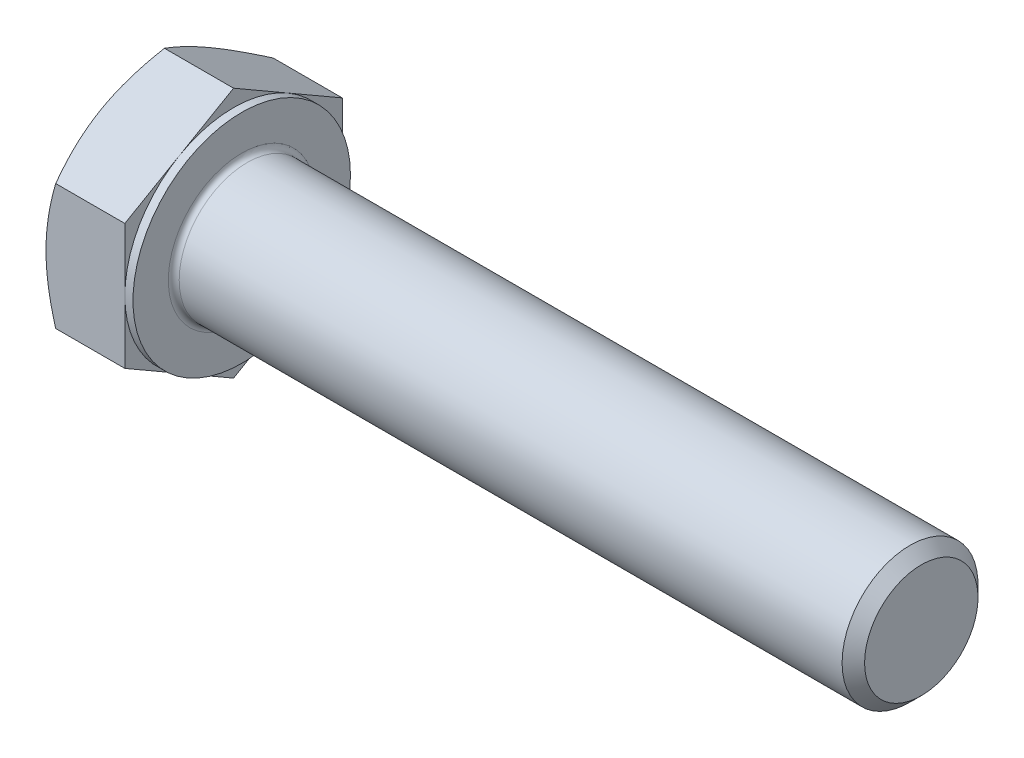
ISO-10303-21;
HEADER;
FILE_DESCRIPTION(('STEP AP214'),'2;1');
FILE_NAME('part.step','',(''),(''),'','','');
FILE_SCHEMA(('AUTOMOTIVE_DESIGN { 1 0 10303 214 1 1 1 1 }'));
ENDSEC;
DATA;
#1=APPLICATION_CONTEXT('core data for automotive mechanical design processes');
#2=APPLICATION_PROTOCOL_DEFINITION('international standard','automotive_design',2000,#1);
#3=PRODUCT_CONTEXT('',#1,'mechanical');
#4=PRODUCT('Part','Part','',(#3));
#5=PRODUCT_RELATED_PRODUCT_CATEGORY('part','',(#4));
#6=PRODUCT_DEFINITION_FORMATION('','',#4);
#7=PRODUCT_DEFINITION_CONTEXT('part definition',#1,'design');
#8=PRODUCT_DEFINITION('design','',#6,#7);
#9=PRODUCT_DEFINITION_SHAPE('','',#8);
#10=(LENGTH_UNIT() NAMED_UNIT(*) SI_UNIT(.MILLI.,.METRE.));
#11=(NAMED_UNIT(*) PLANE_ANGLE_UNIT() SI_UNIT($,.RADIAN.));
#12=(NAMED_UNIT(*) SI_UNIT($,.STERADIAN.) SOLID_ANGLE_UNIT());
#13=UNCERTAINTY_MEASURE_WITH_UNIT(LENGTH_MEASURE(1.E-05),#10,'distance_accuracy_value','');
#14=(GEOMETRIC_REPRESENTATION_CONTEXT(3) GLOBAL_UNCERTAINTY_ASSIGNED_CONTEXT((#13)) GLOBAL_UNIT_ASSIGNED_CONTEXT((#10,
#11,#12)) REPRESENTATION_CONTEXT('',''));
#15=CARTESIAN_POINT('',(0.,0.,0.));
#16=DIRECTION('',(0.,0.,1.));
#17=DIRECTION('',(1.,0.,0.));
#18=AXIS2_PLACEMENT_3D('',#15,#16,#17);
#19=CARTESIAN_POINT('',(6.4,9.23760430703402,0.));
#20=DIRECTION('',(1.,0.,0.));
#21=DIRECTION('',(0.,0.,-1.));
#22=AXIS2_PLACEMENT_3D('',#19,#20,#21);
#23=PLANE('',#22);
#24=CARTESIAN_POINT('',(6.4,0.,0.));
#25=DIRECTION('',(1.,0.,0.));
#26=DIRECTION('',(0.,0.,-1.));
#27=AXIS2_PLACEMENT_3D('',#24,#25,#26);
#28=CIRCLE('',#27,5.4);
#29=CARTESIAN_POINT('',(6.4,0.,-5.4));
#30=VERTEX_POINT('',#29);
#31=EDGE_CURVE('E38',#30,#30,#28,.F.);
#32=ORIENTED_EDGE('',*,*,#31,.T.);
#33=EDGE_LOOP('',(#32));
#34=FACE_BOUND('',#33,.T.);
#35=CARTESIAN_POINT('',(6.4,0.,0.));
#36=DIRECTION('',(1.,0.,0.));
#37=DIRECTION('',(0.,0.,-1.));
#38=AXIS2_PLACEMENT_3D('',#35,#36,#37);
#39=CIRCLE('',#38,8.);
#40=CARTESIAN_POINT('',(6.4,0.,-8.));
#41=VERTEX_POINT('',#40);
#42=EDGE_CURVE('E289',#41,#41,#39,.T.);
#43=ORIENTED_EDGE('',*,*,#42,.T.);
#44=EDGE_LOOP('',(#43));
#45=FACE_BOUND('',#44,.T.);
#46=ADVANCED_FACE('F30',(#34,#45),#23,.T.);
#47=CARTESIAN_POINT('',(0.,0.,0.));
#48=DIRECTION('',(-1.,0.,0.));
#49=DIRECTION('',(0.,0.,1.));
#50=AXIS2_PLACEMENT_3D('',#47,#48,#49);
#51=CYLINDRICAL_SURFACE('',#50,5.);
#52=CARTESIAN_POINT('',(6.8,0.,0.));
#53=DIRECTION('',(1.,0.,0.));
#54=DIRECTION('',(0.,0.,-1.));
#55=AXIS2_PLACEMENT_3D('',#52,#53,#54);
#56=CIRCLE('',#55,5.);
#57=CARTESIAN_POINT('',(6.8,0.,-5.));
#58=VERTEX_POINT('',#57);
#59=EDGE_CURVE('E11',#58,#58,#56,.T.);
#60=ORIENTED_EDGE('',*,*,#59,.T.);
#61=EDGE_LOOP('',(#60));
#62=FACE_BOUND('',#61,.T.);
#63=CARTESIAN_POINT('',(55.572,0.,0.));
#64=DIRECTION('',(-1.,0.,0.));
#65=DIRECTION('',(0.,0.,1.));
#66=AXIS2_PLACEMENT_3D('',#63,#64,#65);
#67=CIRCLE('',#66,5.);
#68=CARTESIAN_POINT('',(55.572,0.,5.));
#69=VERTEX_POINT('',#68);
#70=EDGE_CURVE('E268',#69,#69,#67,.T.);
#71=ORIENTED_EDGE('',*,*,#70,.T.);
#72=EDGE_LOOP('',(#71));
#73=FACE_BOUND('',#72,.T.);
#74=ADVANCED_FACE('F242',(#62,#73),#51,.T.);
#75=CARTESIAN_POINT('',(56.4,0.,0.));
#76=DIRECTION('',(-1.,0.,0.));
#77=DIRECTION('',(0.,0.,1.));
#78=AXIS2_PLACEMENT_3D('',#75,#76,#77);
#79=CONICAL_SURFACE('',#78,4.172,0.785398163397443);
#80=ORIENTED_EDGE('',*,*,#70,.F.);
#81=EDGE_LOOP('',(#80));
#82=FACE_BOUND('',#81,.T.);
#83=CARTESIAN_POINT('',(56.4,0.,0.));
#84=DIRECTION('',(-1.,0.,0.));
#85=DIRECTION('',(0.,0.,1.));
#86=AXIS2_PLACEMENT_3D('',#83,#84,#85);
#87=CIRCLE('',#86,4.172);
#88=CARTESIAN_POINT('',(56.4,0.,4.172));
#89=VERTEX_POINT('',#88);
#90=EDGE_CURVE('E266',#89,#89,#87,.T.);
#91=ORIENTED_EDGE('',*,*,#90,.T.);
#92=EDGE_LOOP('',(#91));
#93=FACE_BOUND('',#92,.T.);
#94=ADVANCED_FACE('F247',(#82,#93),#79,.T.);
#95=CARTESIAN_POINT('',(56.4,0.,0.));
#96=DIRECTION('',(-1.,0.,0.));
#97=DIRECTION('',(0.,0.,1.));
#98=AXIS2_PLACEMENT_3D('',#95,#96,#97);
#99=PLANE('',#98);
#100=ORIENTED_EDGE('',*,*,#90,.F.);
#101=EDGE_LOOP('',(#100));
#102=FACE_BOUND('',#101,.T.);
#103=ADVANCED_FACE('F254',(#102),#99,.F.);
#104=CARTESIAN_POINT('',(5.8,8.,0.));
#105=DIRECTION('',(1.,0.,0.));
#106=DIRECTION('',(0.,0.,-1.));
#107=AXIS2_PLACEMENT_3D('',#104,#105,#106);
#108=PLANE('',#107);
#109=DIRECTION('',(0.,0.500000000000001,0.866025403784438));
#110=VECTOR('',#109,1.);
#111=CARTESIAN_POINT('',(5.8,4.618802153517,-8.));
#112=LINE('',#111,#110);
#113=CARTESIAN_POINT('',(5.8,4.618802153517,-8.));
#114=VERTEX_POINT('',#113);
#115=CARTESIAN_POINT('',(5.8,6.9282032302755,-4.00000000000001));
#116=VERTEX_POINT('',#115);
#117=EDGE_CURVE('E162',#114,#116,#112,.T.);
#118=ORIENTED_EDGE('',*,*,#117,.T.);
#119=CARTESIAN_POINT('',(5.8,0.,0.));
#120=DIRECTION('',(-1.,0.,0.));
#121=DIRECTION('',(0.,0.,1.));
#122=AXIS2_PLACEMENT_3D('',#119,#120,#121);
#123=CIRCLE('',#122,8.);
#124=CARTESIAN_POINT('',(5.8,0.,-8.));
#125=VERTEX_POINT('',#124);
#126=EDGE_CURVE('E45',#116,#125,#123,.T.);
#127=ORIENTED_EDGE('',*,*,#126,.T.);
#128=DIRECTION('',(0.,1.,0.));
#129=VECTOR('',#128,1.);
#130=CARTESIAN_POINT('',(5.8,4.618802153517,-8.));
#131=LINE('',#130,#129);
#132=EDGE_CURVE('E292',#125,#114,#131,.T.);
#133=ORIENTED_EDGE('',*,*,#132,.T.);
#134=EDGE_LOOP('',(#118,#127,#133));
#135=FACE_BOUND('',#134,.T.);
#136=ADVANCED_FACE('F257',(#135),#108,.T.);
#137=CARTESIAN_POINT('',(5.8,9.23760430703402,0.));
#138=VERTEX_POINT('',#137);
#139=EDGE_CURVE('E160',#116,#138,#112,.T.);
#140=ORIENTED_EDGE('',*,*,#139,.T.);
#141=DIRECTION('',(0.,-0.500000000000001,0.866025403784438));
#142=VECTOR('',#141,1.);
#143=CARTESIAN_POINT('',(5.8,9.23760430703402,0.));
#144=LINE('',#143,#142);
#145=CARTESIAN_POINT('',(5.8,6.92820323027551,4.00000000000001));
#146=VERTEX_POINT('',#145);
#147=EDGE_CURVE('E159',#138,#146,#144,.T.);
#148=ORIENTED_EDGE('',*,*,#147,.T.);
#149=EDGE_CURVE('E148',#146,#116,#123,.T.);
#150=ORIENTED_EDGE('',*,*,#149,.T.);
#151=EDGE_LOOP('',(#140,#148,#150));
#152=FACE_BOUND('',#151,.T.);
#153=ADVANCED_FACE('F262',(#152),#108,.T.);
#154=CARTESIAN_POINT('',(5.8,4.61880215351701,8.));
#155=VERTEX_POINT('',#154);
#156=EDGE_CURVE('E127',#146,#155,#144,.T.);
#157=ORIENTED_EDGE('',*,*,#156,.T.);
#158=DIRECTION('',(0.,-1.,0.));
#159=VECTOR('',#158,1.);
#160=CARTESIAN_POINT('',(5.8,4.61880215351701,8.));
#161=LINE('',#160,#159);
#162=CARTESIAN_POINT('',(5.8,0.,8.));
#163=VERTEX_POINT('',#162);
#164=EDGE_CURVE('E121',#155,#163,#161,.T.);
#165=ORIENTED_EDGE('',*,*,#164,.T.);
#166=EDGE_CURVE('E125',#163,#146,#123,.T.);
#167=ORIENTED_EDGE('',*,*,#166,.T.);
#168=EDGE_LOOP('',(#157,#165,#167));
#169=FACE_BOUND('',#168,.T.);
#170=ADVANCED_FACE('F123',(#169),#108,.T.);
#171=CARTESIAN_POINT('',(5.8,-4.61880215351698,8.));
#172=VERTEX_POINT('',#171);
#173=EDGE_CURVE('E131',#163,#172,#161,.T.);
#174=ORIENTED_EDGE('',*,*,#173,.T.);
#175=DIRECTION('',(0.,-0.500000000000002,-0.866025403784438));
#176=VECTOR('',#175,1.);
#177=CARTESIAN_POINT('',(5.8,-9.23760430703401,0.));
#178=LINE('',#177,#176);
#179=CARTESIAN_POINT('',(5.8,-6.9282032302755,4.00000000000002));
#180=VERTEX_POINT('',#179);
#181=EDGE_CURVE('E138',#172,#180,#178,.T.);
#182=ORIENTED_EDGE('',*,*,#181,.T.);
#183=EDGE_CURVE('E135',#180,#163,#123,.T.);
#184=ORIENTED_EDGE('',*,*,#183,.T.);
#185=EDGE_LOOP('',(#174,#182,#184));
#186=FACE_BOUND('',#185,.T.);
#187=ADVANCED_FACE('F136',(#186),#108,.T.);
#188=CARTESIAN_POINT('',(5.8,-9.23760430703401,0.));
#189=VERTEX_POINT('',#188);
#190=EDGE_CURVE('E154',#180,#189,#178,.T.);
#191=ORIENTED_EDGE('',*,*,#190,.T.);
#192=DIRECTION('',(0.,0.499999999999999,-0.866025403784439));
#193=VECTOR('',#192,1.);
#194=CARTESIAN_POINT('',(5.8,-4.61880215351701,-8.));
#195=LINE('',#194,#193);
#196=CARTESIAN_POINT('',(5.8,-6.92820323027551,-3.99999999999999));
#197=VERTEX_POINT('',#196);
#198=EDGE_CURVE('E330',#189,#197,#195,.T.);
#199=ORIENTED_EDGE('',*,*,#198,.T.);
#200=EDGE_CURVE('E142',#197,#180,#123,.T.);
#201=ORIENTED_EDGE('',*,*,#200,.T.);
#202=EDGE_LOOP('',(#191,#199,#201));
#203=FACE_BOUND('',#202,.T.);
#204=ADVANCED_FACE('F331',(#203),#108,.T.);
#205=CARTESIAN_POINT('',(5.8,-4.61880215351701,-8.));
#206=VERTEX_POINT('',#205);
#207=EDGE_CURVE('E149',#197,#206,#195,.T.);
#208=ORIENTED_EDGE('',*,*,#207,.T.);
#209=EDGE_CURVE('E293',#206,#125,#131,.T.);
#210=ORIENTED_EDGE('',*,*,#209,.T.);
#211=EDGE_CURVE('E300',#125,#197,#123,.T.);
#212=ORIENTED_EDGE('',*,*,#211,.T.);
#213=EDGE_LOOP('',(#208,#210,#212));
#214=FACE_BOUND('',#213,.T.);
#215=ADVANCED_FACE('F263',(#214),#108,.T.);
#216=CARTESIAN_POINT('',(0.,0.,0.));
#217=DIRECTION('',(-1.,0.,0.));
#218=DIRECTION('',(0.,0.,1.));
#219=AXIS2_PLACEMENT_3D('',#216,#217,#218);
#220=CYLINDRICAL_SURFACE('',#219,8.);
#221=ORIENTED_EDGE('',*,*,#126,.F.);
#222=ORIENTED_EDGE('',*,*,#149,.F.);
#223=ORIENTED_EDGE('',*,*,#166,.F.);
#224=ORIENTED_EDGE('',*,*,#183,.F.);
#225=ORIENTED_EDGE('',*,*,#200,.F.);
#226=ORIENTED_EDGE('',*,*,#211,.F.);
#227=EDGE_LOOP('',(#221,#222,#223,#224,#225,#226));
#228=FACE_BOUND('',#227,.T.);
#229=ORIENTED_EDGE('',*,*,#42,.F.);
#230=EDGE_LOOP('',(#229));
#231=FACE_BOUND('',#230,.T.);
#232=ADVANCED_FACE('F145',(#228,#231),#220,.T.);
#233=CARTESIAN_POINT('',(0.,9.23760430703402,0.));
#234=DIRECTION('',(1.,0.,0.));
#235=DIRECTION('',(0.,0.,-1.));
#236=AXIS2_PLACEMENT_3D('',#233,#234,#235);
#237=PLANE('',#236);
#238=CARTESIAN_POINT('',(0.,0.,0.));
#239=DIRECTION('',(1.,0.,0.));
#240=DIRECTION('',(0.,0.,-1.));
#241=AXIS2_PLACEMENT_3D('',#238,#239,#240);
#242=CIRCLE('',#241,8.);
#243=CARTESIAN_POINT('',(0.,0.,-8.));
#244=VERTEX_POINT('',#243);
#245=CARTESIAN_POINT('',(0.,6.9282032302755,-4.00000000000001));
#246=VERTEX_POINT('',#245);
#247=EDGE_CURVE('E288',#244,#246,#242,.T.);
#248=ORIENTED_EDGE('',*,*,#247,.F.);
#249=CARTESIAN_POINT('',(0.,-6.92820323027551,-3.99999999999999));
#250=VERTEX_POINT('',#249);
#251=EDGE_CURVE('E284',#250,#244,#242,.T.);
#252=ORIENTED_EDGE('',*,*,#251,.F.);
#253=CARTESIAN_POINT('',(0.,-6.9282032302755,4.00000000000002));
#254=VERTEX_POINT('',#253);
#255=EDGE_CURVE('E287',#254,#250,#242,.T.);
#256=ORIENTED_EDGE('',*,*,#255,.F.);
#257=CARTESIAN_POINT('',(0.,0.,8.));
#258=VERTEX_POINT('',#257);
#259=EDGE_CURVE('E323',#258,#254,#242,.T.);
#260=ORIENTED_EDGE('',*,*,#259,.F.);
#261=CARTESIAN_POINT('',(0.,0.,0.));
#262=DIRECTION('',(-1.,0.,0.));
#263=DIRECTION('',(0.,0.,1.));
#264=AXIS2_PLACEMENT_3D('',#261,#262,#263);
#265=CIRCLE('',#264,8.);
#266=CARTESIAN_POINT('',(0.,6.92820323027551,4.00000000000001));
#267=VERTEX_POINT('',#266);
#268=EDGE_CURVE('E163',#258,#267,#265,.T.);
#269=ORIENTED_EDGE('',*,*,#268,.T.);
#270=EDGE_CURVE('E346',#246,#267,#242,.T.);
#271=ORIENTED_EDGE('',*,*,#270,.F.);
#272=EDGE_LOOP('',(#248,#252,#256,#260,#269,#271));
#273=FACE_BOUND('',#272,.T.);
#274=ADVANCED_FACE('F192',(#273),#237,.F.);
#275=CARTESIAN_POINT('',(0.,0.,0.));
#276=DIRECTION('',(1.,0.,0.));
#277=DIRECTION('',(0.,0.,-1.));
#278=AXIS2_PLACEMENT_3D('',#275,#276,#277);
#279=CONICAL_SURFACE('',#278,8.,1.0471975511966);
#280=CARTESIAN_POINT('',(0.714597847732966,4.61868668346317,8.0002));
#281=CARTESIAN_POINT('',(0.655990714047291,4.72021302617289,7.8243512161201));
#282=CARTESIAN_POINT('',(0.600043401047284,4.82211789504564,7.64784680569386));
#283=CARTESIAN_POINT('',(0.494201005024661,5.02675523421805,7.29340453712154));
#284=CARTESIAN_POINT('',(0.444308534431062,5.12948804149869,7.11546609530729));
#285=CARTESIAN_POINT('',(0.304692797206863,5.43933133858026,6.57880176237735));
#286=CARTESIAN_POINT('',(0.225281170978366,5.64766491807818,6.21795741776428));
#287=CARTESIAN_POINT('',(0.132161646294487,5.95943209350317,5.67796082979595));
#288=CARTESIAN_POINT('',(0.105634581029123,6.06193429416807,5.50042181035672));
#289=CARTESIAN_POINT('',(0.0611531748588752,6.26740224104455,5.1445408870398));
#290=CARTESIAN_POINT('',(0.0431980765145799,6.37036794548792,4.96619905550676));
#291=CARTESIAN_POINT('',(0.0163156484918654,6.57647664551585,4.60920831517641));
#292=CARTESIAN_POINT('',(0.0073780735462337,6.67961930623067,4.4305599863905));
#293=CARTESIAN_POINT('',(-0.00127769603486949,6.88599991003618,4.07309829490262));
#294=CARTESIAN_POINT('',(-0.000996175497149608,6.98923785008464,3.89428493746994));
#295=CARTESIAN_POINT('',(0.00814502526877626,7.18224506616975,3.5599866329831));
#296=CARTESIAN_POINT('',(0.0158896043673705,7.27202796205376,3.40447809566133));
#297=CARTESIAN_POINT('',(0.0382011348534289,7.45138347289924,3.09382523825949));
#298=CARTESIAN_POINT('',(0.0527685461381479,7.54095607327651,2.93868094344));
#299=CARTESIAN_POINT('',(0.106360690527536,7.80932710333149,2.47384868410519));
#300=CARTESIAN_POINT('',(0.155268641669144,7.98765049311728,2.16498351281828));
#301=CARTESIAN_POINT('',(0.277539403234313,8.34618890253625,1.5439767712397));
#302=CARTESIAN_POINT('',(0.351420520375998,8.52635816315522,1.23191445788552));
#303=CARTESIAN_POINT('',(0.519100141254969,8.88400987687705,0.612443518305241));
#304=CARTESIAN_POINT('',(0.612859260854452,9.06149691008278,0.305026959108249));
#305=CARTESIAN_POINT('',(0.714597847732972,9.23771977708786,-0.000200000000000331));
#306=B_SPLINE_CURVE_WITH_KNOTS('',3,(#280,#281,#282,#283,#284,#285,#286,#287,#288,#289,#290,
#291,#292,#293,#294,#295,#296,#297,#298,#299,#300,#301,#302,#303,#304,#305),.UNSPECIFIED.,.F.,
.F.,(4,2,2,2,2,2,2,2,2,2,2,2,4),(0.,0.63397354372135,1.26821965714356,2.53934712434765,
3.15934343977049,3.77928496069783,4.39852133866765,5.01773858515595,5.55680239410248,
6.09590254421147,7.17487077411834,8.27776850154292,9.37850115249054),.UNSPECIFIED.);
#307=CARTESIAN_POINT('',(0.714531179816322,9.23760430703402,0.));
#308=VERTEX_POINT('',#307);
#309=EDGE_CURVE('E211',#267,#308,#306,.T.);
#310=ORIENTED_EDGE('',*,*,#309,.T.);
#311=CARTESIAN_POINT('',(0.714597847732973,9.23771977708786,0.0002));
#312=CARTESIAN_POINT('',(0.655990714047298,9.13619343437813,-0.175648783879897));
#313=CARTESIAN_POINT('',(0.600043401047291,9.03428856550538,-0.352153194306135));
#314=CARTESIAN_POINT('',(0.494201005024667,8.82965122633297,-0.706595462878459));
#315=CARTESIAN_POINT('',(0.444308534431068,8.72691841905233,-0.884533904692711));
#316=CARTESIAN_POINT('',(0.304692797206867,8.41707512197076,-1.42119823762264));
#317=CARTESIAN_POINT('',(0.225281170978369,8.20874154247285,-1.78204258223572));
#318=CARTESIAN_POINT('',(0.132161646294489,7.89697436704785,-2.32203917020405));
#319=CARTESIAN_POINT('',(0.105634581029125,7.79447216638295,-2.49957818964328));
#320=CARTESIAN_POINT('',(0.0611531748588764,7.58900421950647,-2.8554591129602));
#321=CARTESIAN_POINT('',(0.0431980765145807,7.4860385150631,-3.03380094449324));
#322=CARTESIAN_POINT('',(0.0163156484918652,7.27992981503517,-3.39079168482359));
#323=CARTESIAN_POINT('',(0.00737807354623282,7.17678715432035,-3.5694400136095));
#324=CARTESIAN_POINT('',(-0.00127769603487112,6.97040655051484,-3.92690170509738));
#325=CARTESIAN_POINT('',(-0.000996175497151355,6.86716861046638,-4.10571506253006));
#326=CARTESIAN_POINT('',(0.00814502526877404,6.67416139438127,-4.4400133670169));
#327=CARTESIAN_POINT('',(0.0158896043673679,6.58437849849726,-4.59552190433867));
#328=CARTESIAN_POINT('',(0.0382011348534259,6.40502298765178,-4.90617476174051));
#329=CARTESIAN_POINT('',(0.0527685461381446,6.31545038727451,-5.06131905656));
#330=CARTESIAN_POINT('',(0.106360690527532,6.04707935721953,-5.52615131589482));
#331=CARTESIAN_POINT('',(0.15526864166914,5.86875596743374,-5.83501648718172));
#332=CARTESIAN_POINT('',(0.277539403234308,5.51021755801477,-6.4560232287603));
#333=CARTESIAN_POINT('',(0.351420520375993,5.3300482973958,-6.76808554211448));
#334=CARTESIAN_POINT('',(0.519100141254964,4.97239658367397,-7.38755648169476));
#335=CARTESIAN_POINT('',(0.612859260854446,4.79490955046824,-7.69497304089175));
#336=CARTESIAN_POINT('',(0.714597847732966,4.61868668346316,-8.0002));
#337=B_SPLINE_CURVE_WITH_KNOTS('',3,(#311,#312,#313,#314,#315,#316,#317,#318,#319,#320,#321,
#322,#323,#324,#325,#326,#327,#328,#329,#330,#331,#332,#333,#334,#335,#336),.UNSPECIFIED.,.F.,
.F.,(4,2,2,2,2,2,2,2,2,2,2,2,4),(0.,0.63397354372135,1.26821965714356,2.53934712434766,
3.15934343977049,3.77928496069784,4.39852133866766,5.01773858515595,5.55680239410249,
6.09590254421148,7.17487077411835,8.27776850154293,9.37850115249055),.UNSPECIFIED.);
#338=EDGE_CURVE('E53',#308,#246,#337,.T.);
#339=ORIENTED_EDGE('',*,*,#338,.T.);
#340=ORIENTED_EDGE('',*,*,#270,.T.);
#341=EDGE_LOOP('',(#310,#339,#340));
#342=FACE_BOUND('',#341,.T.);
#343=ADVANCED_FACE('F347',(#342),#279,.T.);
#344=CARTESIAN_POINT('',(4.02490591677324,-12.6546855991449,8.));
#345=CARTESIAN_POINT('',(3.85338488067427,-12.3031246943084,8.));
#346=CARTESIAN_POINT('',(3.68343820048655,-11.9507829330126,8.));
#347=CARTESIAN_POINT('',(3.34757428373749,-11.2441233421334,8.));
#348=CARTESIAN_POINT('',(3.18165763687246,-10.8898052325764,8.));
#349=CARTESIAN_POINT('',(2.85395194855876,-10.1770689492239,8.));
#350=CARTESIAN_POINT('',(2.69218825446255,-9.81863908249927,8.));
#351=CARTESIAN_POINT('',(2.37495727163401,-9.09901413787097,8.));
#352=CARTESIAN_POINT('',(2.21948970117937,-8.73781918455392,8.));
#353=CARTESIAN_POINT('',(1.91124909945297,-7.99950052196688,8.));
#354=CARTESIAN_POINT('',(1.75875676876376,-7.62225899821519,8.));
#355=CARTESIAN_POINT('',(1.46472411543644,-6.86345577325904,8.));
#356=CARTESIAN_POINT('',(1.32318498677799,-6.4818936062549,8.));
#357=CARTESIAN_POINT('',(1.05459432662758,-5.71447512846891,8.));
#358=CARTESIAN_POINT('',(0.927515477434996,-5.3286284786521,8.));
#359=CARTESIAN_POINT('',(0.691757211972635,-4.55141880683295,8.));
#360=CARTESIAN_POINT('',(0.583072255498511,-4.16005748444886,8.));
#361=CARTESIAN_POINT('',(0.389750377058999,-3.37376378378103,8.));
#362=CARTESIAN_POINT('',(0.304973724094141,-2.9788666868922,8.));
#363=CARTESIAN_POINT('',(0.199275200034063,-2.38273452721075,8.));
#364=CARTESIAN_POINT('',(0.167618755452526,-2.18337977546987,8.));
#365=CARTESIAN_POINT('',(0.112075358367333,-1.78359737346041,8.));
#366=CARTESIAN_POINT('',(0.0881876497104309,-1.58316982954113,8.));
#367=CARTESIAN_POINT('',(0.0489706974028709,-1.184235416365,8.));
#368=CARTESIAN_POINT('',(0.0335291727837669,-0.985739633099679,8.));
#369=CARTESIAN_POINT('',(0.0110629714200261,-0.588272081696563,8.));
#370=CARTESIAN_POINT('',(0.00403814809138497,-0.389300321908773,8.));
#371=CARTESIAN_POINT('',(-0.00142584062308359,0.0087622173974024,8.));
#372=CARTESIAN_POINT('',(0.000134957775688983,0.207852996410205,8.));
#373=CARTESIAN_POINT('',(0.0118014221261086,0.605786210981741,8.));
#374=CARTESIAN_POINT('',(0.0219074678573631,0.804628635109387,8.));
#375=CARTESIAN_POINT('',(0.0557165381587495,1.27520492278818,8.));
#376=CARTESIAN_POINT('',(0.0830672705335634,1.54668292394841,8.));
#377=CARTESIAN_POINT('',(0.152259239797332,2.0877709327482,8.));
#378=CARTESIAN_POINT('',(0.194102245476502,2.35738070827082,8.));
#379=CARTESIAN_POINT('',(0.339163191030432,3.16301775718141,8.));
#380=CARTESIAN_POINT('',(0.46189129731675,3.69558689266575,8.));
#381=CARTESIAN_POINT('',(0.676586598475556,4.49226054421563,8.));
#382=CARTESIAN_POINT('',(0.754301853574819,4.76044513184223,8.));
#383=CARTESIAN_POINT('',(0.918275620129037,5.29421545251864,8.));
#384=CARTESIAN_POINT('',(1.00453419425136,5.55980116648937,8.));
#385=CARTESIAN_POINT('',(1.18417203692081,6.08844838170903,8.));
#386=CARTESIAN_POINT('',(1.2775493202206,6.3515105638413,8.));
#387=CARTESIAN_POINT('',(1.47027925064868,6.87542422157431,8.));
#388=CARTESIAN_POINT('',(1.56963178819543,7.13627573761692,8.));
#389=CARTESIAN_POINT('',(1.83061788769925,7.80218876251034,8.));
#390=CARTESIAN_POINT('',(1.99585031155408,8.20583801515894,8.));
#391=CARTESIAN_POINT('',(2.33560644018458,9.00922091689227,8.));
#392=CARTESIAN_POINT('',(2.51013099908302,9.40895420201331,7.99999999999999));
#393=CARTESIAN_POINT('',(2.8664148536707,10.2053302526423,7.99999999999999));
#394=CARTESIAN_POINT('',(3.04817649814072,10.6019719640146,7.99999999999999));
#395=CARTESIAN_POINT('',(3.41731475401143,11.3926098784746,7.99999999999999));
#396=CARTESIAN_POINT('',(3.60469118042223,11.7866061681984,7.99999999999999));
#397=CARTESIAN_POINT('',(3.98417977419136,12.5730081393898,7.99999999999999));
#398=CARTESIAN_POINT('',(4.17629838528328,12.9654107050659,7.99999999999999));
#399=CARTESIAN_POINT('',(4.56413461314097,13.7484335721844,7.99999999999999));
#400=CARTESIAN_POINT('',(4.75985225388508,14.1390538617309,7.99999999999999));
#401=CARTESIAN_POINT('',(5.15417791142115,14.9187387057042,7.99999999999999));
#402=CARTESIAN_POINT('',(5.3527853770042,15.3078035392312,7.99999999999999));
#403=CARTESIAN_POINT('',(5.75241278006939,16.0846929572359,7.99999999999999));
#404=CARTESIAN_POINT('',(5.95343272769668,16.4725175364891,7.99999999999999));
#405=CARTESIAN_POINT('',(6.52023158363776,17.559169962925,7.99999999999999));
#406=CARTESIAN_POINT('',(6.88826669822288,18.2568208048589,7.99999999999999));
#407=CARTESIAN_POINT('',(7.62911646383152,19.6496204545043,7.99999999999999));
#408=CARTESIAN_POINT('',(8.00193136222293,20.3447691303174,7.99999999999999));
#409=CARTESIAN_POINT('',(8.74998840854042,21.7309493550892,7.99999999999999));
#410=CARTESIAN_POINT('',(9.12521930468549,22.4219869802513,7.99999999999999));
#411=CARTESIAN_POINT('',(9.69012626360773,23.4573861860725,7.99999999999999));
#412=CARTESIAN_POINT('',(9.87876537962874,23.8023143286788,7.99999999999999));
#413=CARTESIAN_POINT('',(10.2566598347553,24.491832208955,7.99999999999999));
#414=CARTESIAN_POINT('',(10.4459151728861,24.8364219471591,7.99999999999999));
#415=CARTESIAN_POINT('',(10.6354414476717,25.1808626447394,7.99999999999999));
#416=B_SPLINE_CURVE_WITH_KNOTS('',3,(#344,#345,#346,#347,#348,#349,#350,#351,#352,#353,#354,
#355,#356,#357,#358,#359,#360,#361,#362,#363,#364,#365,#366,#367,#368,#369,#370,#371,#372,#373,
#374,#375,#376,#377,#378,#379,#380,#381,#382,#383,#384,#385,#386,#387,#388,#389,#390,#391,#392,
#393,#394,#395,#396,#397,#398,#399,#400,#401,#402,#403,#404,#405,#406,#407,#408,#409,#410,#411,
#412,#413,#414,#415),.UNSPECIFIED.,.F.,.F.,(4,2,2,2,2,2,2,2,2,2,2,2,2,2,2,2,2,2,2,2,2,2,2,2,2,2,
2,2,2,2,2,2,2,2,2,4),(0.,1.17352534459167,2.34722138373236,3.52689945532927,4.70652468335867,
5.92708318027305,7.1477745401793,8.36612013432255,9.58409810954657,10.7948027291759,
11.40023293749,12.0056041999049,12.6027191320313,13.1998236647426,13.7969256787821,
14.3940542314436,15.2121538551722,16.0303533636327,17.6675489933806,18.5051258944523,
19.3427089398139,20.180059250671,21.0173942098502,22.3257038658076,23.6341339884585,
24.9429922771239,26.2518074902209,27.5625113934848,28.8732240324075,30.1836898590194,
31.4941611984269,33.8604586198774,36.2268790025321,38.5858914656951,39.7653151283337,
40.9447369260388),.UNSPECIFIED.);
#417=CARTESIAN_POINT('',(0.714531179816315,4.61880215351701,8.));
#418=VERTEX_POINT('',#417);
#419=EDGE_CURVE('E223',#258,#418,#416,.T.);
#420=ORIENTED_EDGE('',*,*,#419,.T.);
#421=EDGE_CURVE('E222',#418,#267,#306,.T.);
#422=ORIENTED_EDGE('',*,*,#421,.T.);
#423=ORIENTED_EDGE('',*,*,#268,.F.);
#424=EDGE_LOOP('',(#420,#422,#423));
#425=FACE_BOUND('',#424,.T.);
#426=ADVANCED_FACE('F317',(#425),#279,.T.);
#427=CARTESIAN_POINT('',(0.714531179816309,-4.61880215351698,8.));
#428=VERTEX_POINT('',#427);
#429=EDGE_CURVE('E269',#428,#258,#416,.T.);
#430=ORIENTED_EDGE('',*,*,#429,.T.);
#431=ORIENTED_EDGE('',*,*,#259,.T.);
#432=CARTESIAN_POINT('',(0.714597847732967,-9.23771977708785,-0.000200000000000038));
#433=CARTESIAN_POINT('',(0.655990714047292,-9.13619343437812,0.175648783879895));
#434=CARTESIAN_POINT('',(0.600043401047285,-9.03428856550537,0.352153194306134));
#435=CARTESIAN_POINT('',(0.494201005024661,-8.82965122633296,0.706595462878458));
#436=CARTESIAN_POINT('',(0.444308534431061,-8.72691841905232,0.88453390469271));
#437=CARTESIAN_POINT('',(0.304692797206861,-8.41707512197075,1.42119823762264));
#438=CARTESIAN_POINT('',(0.225281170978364,-8.20874154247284,1.78204258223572));
#439=CARTESIAN_POINT('',(0.132161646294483,-7.89697436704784,2.32203917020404));
#440=CARTESIAN_POINT('',(0.105634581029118,-7.79447216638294,2.49957818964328));
#441=CARTESIAN_POINT('',(0.0611531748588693,-7.58900421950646,2.85545911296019));
#442=CARTESIAN_POINT('',(0.043198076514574,-7.48603851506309,3.03380094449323));
#443=CARTESIAN_POINT('',(0.0163156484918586,-7.27992981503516,3.39079168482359));
#444=CARTESIAN_POINT('',(0.007378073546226,-7.17678715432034,3.56944001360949));
#445=CARTESIAN_POINT('',(-0.00127769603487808,-6.97040655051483,3.92690170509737));
#446=CARTESIAN_POINT('',(-0.000996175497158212,-6.86716861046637,4.10571506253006));
#447=CARTESIAN_POINT('',(0.00814502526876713,-6.67416139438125,4.44001336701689));
#448=CARTESIAN_POINT('',(0.0158896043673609,-6.58437849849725,4.59552190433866));
#449=CARTESIAN_POINT('',(0.0382011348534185,-6.40502298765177,4.9061747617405));
#450=CARTESIAN_POINT('',(0.0527685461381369,-6.3154503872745,5.06131905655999));
#451=CARTESIAN_POINT('',(0.106360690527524,-6.04707935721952,5.52615131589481));
#452=CARTESIAN_POINT('',(0.155268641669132,-5.86875596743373,5.83501648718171));
#453=CARTESIAN_POINT('',(0.2775394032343,-5.51021755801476,6.45602322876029));
#454=CARTESIAN_POINT('',(0.351420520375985,-5.33004829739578,6.76808554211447));
#455=CARTESIAN_POINT('',(0.519100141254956,-4.97239658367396,7.38755648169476));
#456=CARTESIAN_POINT('',(0.612859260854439,-4.79490955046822,7.69497304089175));
#457=CARTESIAN_POINT('',(0.71459784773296,-4.61868668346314,8.0002));
#458=B_SPLINE_CURVE_WITH_KNOTS('',3,(#432,#433,#434,#435,#436,#437,#438,#439,#440,#441,#442,
#443,#444,#445,#446,#447,#448,#449,#450,#451,#452,#453,#454,#455,#456,#457),.UNSPECIFIED.,.F.,
.F.,(4,2,2,2,2,2,2,2,2,2,2,2,4),(0.,0.63397354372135,1.26821965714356,2.53934712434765,
3.15934343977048,3.77928496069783,4.39852133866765,5.01773858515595,5.55680239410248,
6.09590254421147,7.17487077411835,8.27776850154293,9.37850115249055),.UNSPECIFIED.);
#459=EDGE_CURVE('E213',#254,#428,#458,.T.);
#460=ORIENTED_EDGE('',*,*,#459,.T.);
#461=EDGE_LOOP('',(#430,#431,#460));
#462=FACE_BOUND('',#461,.T.);
#463=ADVANCED_FACE('F181',(#462),#279,.T.);
#464=CARTESIAN_POINT('',(0.714531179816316,-9.23760430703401,0.));
#465=VERTEX_POINT('',#464);
#466=EDGE_CURVE('E206',#465,#254,#458,.T.);
#467=ORIENTED_EDGE('',*,*,#466,.T.);
#468=ORIENTED_EDGE('',*,*,#255,.T.);
#469=CARTESIAN_POINT('',(0.714597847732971,-4.61868668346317,-8.0002));
#470=CARTESIAN_POINT('',(0.655990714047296,-4.7202130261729,-7.82435121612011));
#471=CARTESIAN_POINT('',(0.600043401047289,-4.82211789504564,-7.64784680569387));
#472=CARTESIAN_POINT('',(0.494201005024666,-5.02675523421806,-7.29340453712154));
#473=CARTESIAN_POINT('',(0.444308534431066,-5.1294880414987,-7.11546609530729));
#474=CARTESIAN_POINT('',(0.304692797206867,-5.43933133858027,-6.57880176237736));
#475=CARTESIAN_POINT('',(0.22528117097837,-5.64766491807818,-6.21795741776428));
#476=CARTESIAN_POINT('',(0.13216164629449,-5.95943209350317,-5.67796082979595));
#477=CARTESIAN_POINT('',(0.105634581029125,-6.06193429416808,-5.50042181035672));
#478=CARTESIAN_POINT('',(0.0611531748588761,-6.26740224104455,-5.1445408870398));
#479=CARTESIAN_POINT('',(0.0431980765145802,-6.37036794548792,-4.96619905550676));
#480=CARTESIAN_POINT('',(0.0163156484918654,-6.57647664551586,-4.60920831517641));
#481=CARTESIAN_POINT('',(0.00737807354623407,-6.67961930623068,-4.4305599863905));
#482=CARTESIAN_POINT('',(-0.00127769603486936,-6.88599991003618,-4.07309829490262));
#483=CARTESIAN_POINT('',(-0.000996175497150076,-6.98923785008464,-3.89428493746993));
#484=CARTESIAN_POINT('',(0.00814502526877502,-7.18224506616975,-3.5599866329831));
#485=CARTESIAN_POINT('',(0.015889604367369,-7.27202796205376,-3.40447809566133));
#486=CARTESIAN_POINT('',(0.0382011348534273,-7.45138347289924,-3.09382523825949));
#487=CARTESIAN_POINT('',(0.0527685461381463,-7.5409560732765,-2.93868094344));
#488=CARTESIAN_POINT('',(0.106360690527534,-7.80932710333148,-2.47384868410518));
#489=CARTESIAN_POINT('',(0.155268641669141,-7.98765049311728,-2.16498351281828));
#490=CARTESIAN_POINT('',(0.277539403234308,-8.34618890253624,-1.5439767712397));
#491=CARTESIAN_POINT('',(0.351420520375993,-8.52635816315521,-1.23191445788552));
#492=CARTESIAN_POINT('',(0.519100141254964,-8.88400987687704,-0.612443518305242));
#493=CARTESIAN_POINT('',(0.612859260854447,-9.06149691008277,-0.305026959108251));
#494=CARTESIAN_POINT('',(0.714597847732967,-9.23771977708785,0.000200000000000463));
#495=B_SPLINE_CURVE_WITH_KNOTS('',3,(#469,#470,#471,#472,#473,#474,#475,#476,#477,#478,#479,
#480,#481,#482,#483,#484,#485,#486,#487,#488,#489,#490,#491,#492,#493,#494),.UNSPECIFIED.,.F.,
.F.,(4,2,2,2,2,2,2,2,2,2,2,2,4),(0.,0.63397354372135,1.26821965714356,2.53934712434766,
3.15934343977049,3.77928496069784,4.39852133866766,5.01773858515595,5.55680239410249,
6.09590254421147,7.17487077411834,8.27776850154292,9.37850115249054),.UNSPECIFIED.);
#496=EDGE_CURVE('E212',#250,#465,#495,.T.);
#497=ORIENTED_EDGE('',*,*,#496,.T.);
#498=EDGE_LOOP('',(#467,#468,#497));
#499=FACE_BOUND('',#498,.T.);
#500=ADVANCED_FACE('F345',(#499),#279,.T.);
#501=CARTESIAN_POINT('',(0.714531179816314,4.618802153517,-8.));
#502=VERTEX_POINT('',#501);
#503=EDGE_CURVE('E214',#246,#502,#337,.T.);
#504=ORIENTED_EDGE('',*,*,#503,.T.);
#505=CARTESIAN_POINT('',(4.02490591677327,-12.6546855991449,-8.));
#506=CARTESIAN_POINT('',(3.85338488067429,-12.3031246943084,-8.));
#507=CARTESIAN_POINT('',(3.68343820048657,-11.9507829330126,-8.));
#508=CARTESIAN_POINT('',(3.34757428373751,-11.2441233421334,-8.));
#509=CARTESIAN_POINT('',(3.18165763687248,-10.8898052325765,-8.));
#510=CARTESIAN_POINT('',(2.85395194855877,-10.177068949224,-8.));
#511=CARTESIAN_POINT('',(2.69218825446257,-9.81863908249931,-8.));
#512=CARTESIAN_POINT('',(2.37495727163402,-9.099014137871,-8.));
#513=CARTESIAN_POINT('',(2.21948970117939,-8.73781918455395,-8.));
#514=CARTESIAN_POINT('',(1.91124909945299,-7.99950052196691,-8.));
#515=CARTESIAN_POINT('',(1.75875676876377,-7.62225899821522,-8.));
#516=CARTESIAN_POINT('',(1.46472411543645,-6.86345577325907,-8.));
#517=CARTESIAN_POINT('',(1.323184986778,-6.48189360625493,-8.));
#518=CARTESIAN_POINT('',(1.0545943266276,-5.71447512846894,-8.));
#519=CARTESIAN_POINT('',(0.927515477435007,-5.32862847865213,-8.));
#520=CARTESIAN_POINT('',(0.691757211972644,-4.55141880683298,-8.));
#521=CARTESIAN_POINT('',(0.58307225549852,-4.16005748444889,-8.));
#522=CARTESIAN_POINT('',(0.389750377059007,-3.37376378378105,-8.));
#523=CARTESIAN_POINT('',(0.304973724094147,-2.97886668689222,-8.));
#524=CARTESIAN_POINT('',(0.199275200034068,-2.38273452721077,-8.));
#525=CARTESIAN_POINT('',(0.167618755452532,-2.18337977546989,-8.));
#526=CARTESIAN_POINT('',(0.112075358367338,-1.78359737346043,-8.));
#527=CARTESIAN_POINT('',(0.0881876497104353,-1.58316982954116,-8.));
#528=CARTESIAN_POINT('',(0.0489706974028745,-1.18423541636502,-8.));
#529=CARTESIAN_POINT('',(0.03352917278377,-0.985739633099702,-8.));
#530=CARTESIAN_POINT('',(0.0110629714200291,-0.588272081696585,-8.));
#531=CARTESIAN_POINT('',(0.00403814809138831,-0.389300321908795,-8.));
#532=CARTESIAN_POINT('',(-0.00142584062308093,0.00876221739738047,-8.));
#533=CARTESIAN_POINT('',(0.000134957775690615,0.207852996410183,-8.));
#534=CARTESIAN_POINT('',(0.011801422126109,0.60578621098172,-8.));
#535=CARTESIAN_POINT('',(0.0219074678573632,0.804628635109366,-8.));
#536=CARTESIAN_POINT('',(0.0557165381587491,1.27520492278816,-8.));
#537=CARTESIAN_POINT('',(0.0830672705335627,1.54668292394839,-8.));
#538=CARTESIAN_POINT('',(0.152259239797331,2.08777093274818,-8.));
#539=CARTESIAN_POINT('',(0.1941022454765,2.35738070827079,-8.));
#540=CARTESIAN_POINT('',(0.339163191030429,3.16301775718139,-8.));
#541=CARTESIAN_POINT('',(0.461891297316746,3.69558689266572,-8.));
#542=CARTESIAN_POINT('',(0.67658659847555,4.49226054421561,-8.));
#543=CARTESIAN_POINT('',(0.754301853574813,4.76044513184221,-8.));
#544=CARTESIAN_POINT('',(0.91827562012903,5.29421545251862,-8.));
#545=CARTESIAN_POINT('',(1.00453419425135,5.55980116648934,-8.));
#546=CARTESIAN_POINT('',(1.1841720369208,6.088448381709,-8.));
#547=CARTESIAN_POINT('',(1.27754932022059,6.35151056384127,-8.));
#548=CARTESIAN_POINT('',(1.47027925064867,6.87542422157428,-8.));
#549=CARTESIAN_POINT('',(1.56963178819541,7.13627573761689,-8.));
#550=CARTESIAN_POINT('',(1.83061788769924,7.80218876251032,-8.));
#551=CARTESIAN_POINT('',(1.99585031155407,8.20583801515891,-8.));
#552=CARTESIAN_POINT('',(2.33560644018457,9.00922091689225,-8.));
#553=CARTESIAN_POINT('',(2.51013099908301,9.40895420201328,-8.));
#554=CARTESIAN_POINT('',(2.86641485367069,10.2053302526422,-8.));
#555=CARTESIAN_POINT('',(3.04817649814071,10.6019719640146,-8.));
#556=CARTESIAN_POINT('',(3.41731475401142,11.3926098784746,-8.));
#557=CARTESIAN_POINT('',(3.60469118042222,11.7866061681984,-8.));
#558=CARTESIAN_POINT('',(3.98417977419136,12.5730081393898,-8.));
#559=CARTESIAN_POINT('',(4.17629838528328,12.9654107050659,-8.));
#560=CARTESIAN_POINT('',(4.56413461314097,13.7484335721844,-8.));
#561=CARTESIAN_POINT('',(4.75985225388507,14.1390538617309,-8.));
#562=CARTESIAN_POINT('',(5.15417791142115,14.9187387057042,-8.));
#563=CARTESIAN_POINT('',(5.3527853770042,15.3078035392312,-8.));
#564=CARTESIAN_POINT('',(5.75241278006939,16.0846929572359,-8.));
#565=CARTESIAN_POINT('',(5.95343272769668,16.4725175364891,-8.));
#566=CARTESIAN_POINT('',(6.52023158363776,17.559169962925,-8.));
#567=CARTESIAN_POINT('',(6.88826669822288,18.2568208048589,-8.));
#568=CARTESIAN_POINT('',(7.62911646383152,19.6496204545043,-8.));
#569=CARTESIAN_POINT('',(8.00193136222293,20.3447691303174,-8.));
#570=CARTESIAN_POINT('',(8.74998840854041,21.7309493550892,-8.));
#571=CARTESIAN_POINT('',(9.12521930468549,22.4219869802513,-8.));
#572=CARTESIAN_POINT('',(9.69012626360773,23.4573861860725,-8.));
#573=CARTESIAN_POINT('',(9.87876537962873,23.8023143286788,-8.));
#574=CARTESIAN_POINT('',(10.2566598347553,24.491832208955,-8.));
#575=CARTESIAN_POINT('',(10.4459151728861,24.8364219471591,-8.));
#576=CARTESIAN_POINT('',(10.6354414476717,25.1808626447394,-8.));
#577=B_SPLINE_CURVE_WITH_KNOTS('',3,(#505,#506,#507,#508,#509,#510,#511,#512,#513,#514,#515,
#516,#517,#518,#519,#520,#521,#522,#523,#524,#525,#526,#527,#528,#529,#530,#531,#532,#533,#534,
#535,#536,#537,#538,#539,#540,#541,#542,#543,#544,#545,#546,#547,#548,#549,#550,#551,#552,#553,
#554,#555,#556,#557,#558,#559,#560,#561,#562,#563,#564,#565,#566,#567,#568,#569,#570,#571,#572,
#573,#574,#575,#576),.UNSPECIFIED.,.F.,.F.,(4,2,2,2,2,2,2,2,2,2,2,2,2,2,2,2,2,2,2,2,2,2,2,2,2,2,
2,2,2,2,2,2,2,2,2,4),(0.,1.17352534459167,2.34722138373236,3.52689945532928,4.70652468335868,
5.92708318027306,7.14777454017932,8.36612013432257,9.58409810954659,10.7948027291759,
11.40023293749,12.0056041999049,12.6027191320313,13.1998236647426,13.7969256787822,
14.3940542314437,15.2121538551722,16.0303533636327,17.6675489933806,18.5051258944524,
19.3427089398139,20.180059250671,21.0173942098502,22.3257038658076,23.6341339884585,
24.9429922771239,26.2518074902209,27.5625113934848,28.8732240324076,30.1836898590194,
31.4941611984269,33.8604586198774,36.2268790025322,38.5858914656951,39.7653151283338,
40.9447369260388),.UNSPECIFIED.);
#578=EDGE_CURVE('E174',#502,#244,#577,.F.);
#579=ORIENTED_EDGE('',*,*,#578,.T.);
#580=ORIENTED_EDGE('',*,*,#247,.T.);
#581=EDGE_LOOP('',(#504,#579,#580));
#582=FACE_BOUND('',#581,.T.);
#583=ADVANCED_FACE('F342',(#582),#279,.T.);
#584=CARTESIAN_POINT('',(0.714531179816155,-4.61880215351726,-8.));
#585=VERTEX_POINT('',#584);
#586=EDGE_CURVE('E175',#585,#250,#495,.T.);
#587=ORIENTED_EDGE('',*,*,#586,.T.);
#588=ORIENTED_EDGE('',*,*,#251,.T.);
#589=EDGE_CURVE('E166',#244,#585,#577,.F.);
#590=ORIENTED_EDGE('',*,*,#589,.T.);
#591=EDGE_LOOP('',(#587,#588,#590));
#592=FACE_BOUND('',#591,.T.);
#593=ADVANCED_FACE('F190',(#592),#279,.T.);
#594=CARTESIAN_POINT('',(6.4,4.618802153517,-8.));
#595=DIRECTION('',(0.,0.,1.));
#596=DIRECTION('',(0.,-1.,0.));
#597=AXIS2_PLACEMENT_3D('',#594,#595,#596);
#598=PLANE('',#597);
#599=ORIENTED_EDGE('',*,*,#209,.F.);
#600=DIRECTION('',(-1.,0.,0.));
#601=VECTOR('',#600,1.);
#602=CARTESIAN_POINT('',(6.4,-4.61880215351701,-8.));
#603=LINE('',#602,#601);
#604=EDGE_CURVE('E275',#206,#585,#603,.T.);
#605=ORIENTED_EDGE('',*,*,#604,.T.);
#606=ORIENTED_EDGE('',*,*,#589,.F.);
#607=ORIENTED_EDGE('',*,*,#578,.F.);
#608=DIRECTION('',(-1.,0.,0.));
#609=VECTOR('',#608,1.);
#610=CARTESIAN_POINT('',(6.4,4.618802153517,-8.));
#611=LINE('',#610,#609);
#612=EDGE_CURVE('E271',#114,#502,#611,.T.);
#613=ORIENTED_EDGE('',*,*,#612,.F.);
#614=ORIENTED_EDGE('',*,*,#132,.F.);
#615=EDGE_LOOP('',(#599,#605,#606,#607,#613,#614));
#616=FACE_BOUND('',#615,.T.);
#617=ADVANCED_FACE('F185',(#616),#598,.F.);
#618=CARTESIAN_POINT('',(6.4,-4.61880215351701,-8.));
#619=DIRECTION('',(0.,0.866025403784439,0.499999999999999));
#620=DIRECTION('',(0.,-0.499999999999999,0.866025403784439));
#621=AXIS2_PLACEMENT_3D('',#618,#619,#620);
#622=PLANE('',#621);
#623=ORIENTED_EDGE('',*,*,#198,.F.);
#624=DIRECTION('',(-1.,0.,0.));
#625=VECTOR('',#624,1.);
#626=CARTESIAN_POINT('',(6.4,-9.23760430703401,0.));
#627=LINE('',#626,#625);
#628=EDGE_CURVE('E277',#189,#465,#627,.T.);
#629=ORIENTED_EDGE('',*,*,#628,.T.);
#630=ORIENTED_EDGE('',*,*,#496,.F.);
#631=ORIENTED_EDGE('',*,*,#586,.F.);
#632=ORIENTED_EDGE('',*,*,#604,.F.);
#633=ORIENTED_EDGE('',*,*,#207,.F.);
#634=EDGE_LOOP('',(#623,#629,#630,#631,#632,#633));
#635=FACE_BOUND('',#634,.T.);
#636=ADVANCED_FACE('F189',(#635),#622,.F.);
#637=CARTESIAN_POINT('',(6.4,-9.23760430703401,0.));
#638=DIRECTION('',(0.,0.866025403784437,-0.500000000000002));
#639=DIRECTION('',(0.,0.500000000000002,0.866025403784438));
#640=AXIS2_PLACEMENT_3D('',#637,#638,#639);
#641=PLANE('',#640);
#642=ORIENTED_EDGE('',*,*,#181,.F.);
#643=DIRECTION('',(-1.,0.,0.));
#644=VECTOR('',#643,1.);
#645=CARTESIAN_POINT('',(6.4,-4.61880215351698,8.));
#646=LINE('',#645,#644);
#647=EDGE_CURVE('E153',#172,#428,#646,.T.);
#648=ORIENTED_EDGE('',*,*,#647,.T.);
#649=ORIENTED_EDGE('',*,*,#459,.F.);
#650=ORIENTED_EDGE('',*,*,#466,.F.);
#651=ORIENTED_EDGE('',*,*,#628,.F.);
#652=ORIENTED_EDGE('',*,*,#190,.F.);
#653=EDGE_LOOP('',(#642,#648,#649,#650,#651,#652));
#654=FACE_BOUND('',#653,.T.);
#655=ADVANCED_FACE('F197',(#654),#641,.F.);
#656=CARTESIAN_POINT('',(6.4,4.61880215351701,8.));
#657=DIRECTION('',(0.,0.,-1.));
#658=DIRECTION('',(0.,1.,0.));
#659=AXIS2_PLACEMENT_3D('',#656,#657,#658);
#660=PLANE('',#659);
#661=ORIENTED_EDGE('',*,*,#164,.F.);
#662=DIRECTION('',(-1.,0.,0.));
#663=VECTOR('',#662,1.);
#664=CARTESIAN_POINT('',(6.4,4.61880215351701,8.));
#665=LINE('',#664,#663);
#666=EDGE_CURVE('E280',#155,#418,#665,.T.);
#667=ORIENTED_EDGE('',*,*,#666,.T.);
#668=ORIENTED_EDGE('',*,*,#419,.F.);
#669=ORIENTED_EDGE('',*,*,#429,.F.);
#670=ORIENTED_EDGE('',*,*,#647,.F.);
#671=ORIENTED_EDGE('',*,*,#173,.F.);
#672=EDGE_LOOP('',(#661,#667,#668,#669,#670,#671));
#673=FACE_BOUND('',#672,.T.);
#674=ADVANCED_FACE('F151',(#673),#660,.F.);
#675=CARTESIAN_POINT('',(6.4,9.23760430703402,0.));
#676=DIRECTION('',(0.,-0.866025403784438,-0.500000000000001));
#677=DIRECTION('',(0.,0.500000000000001,-0.866025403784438));
#678=AXIS2_PLACEMENT_3D('',#675,#676,#677);
#679=PLANE('',#678);
#680=ORIENTED_EDGE('',*,*,#147,.F.);
#681=DIRECTION('',(-1.,0.,0.));
#682=VECTOR('',#681,1.);
#683=CARTESIAN_POINT('',(6.4,9.23760430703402,0.));
#684=LINE('',#683,#682);
#685=EDGE_CURVE('E282',#138,#308,#684,.T.);
#686=ORIENTED_EDGE('',*,*,#685,.T.);
#687=ORIENTED_EDGE('',*,*,#309,.F.);
#688=ORIENTED_EDGE('',*,*,#421,.F.);
#689=ORIENTED_EDGE('',*,*,#666,.F.);
#690=ORIENTED_EDGE('',*,*,#156,.F.);
#691=EDGE_LOOP('',(#680,#686,#687,#688,#689,#690));
#692=FACE_BOUND('',#691,.T.);
#693=ADVANCED_FACE('F228',(#692),#679,.F.);
#694=CARTESIAN_POINT('',(6.4,4.618802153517,-8.));
#695=DIRECTION('',(0.,-0.866025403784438,0.500000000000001));
#696=DIRECTION('',(0.,-0.500000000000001,-0.866025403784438));
#697=AXIS2_PLACEMENT_3D('',#694,#695,#696);
#698=PLANE('',#697);
#699=ORIENTED_EDGE('',*,*,#117,.F.);
#700=ORIENTED_EDGE('',*,*,#612,.T.);
#701=ORIENTED_EDGE('',*,*,#503,.F.);
#702=ORIENTED_EDGE('',*,*,#338,.F.);
#703=ORIENTED_EDGE('',*,*,#685,.F.);
#704=ORIENTED_EDGE('',*,*,#139,.F.);
#705=EDGE_LOOP('',(#699,#700,#701,#702,#703,#704));
#706=FACE_BOUND('',#705,.T.);
#707=ADVANCED_FACE('F231',(#706),#698,.F.);
#708=CARTESIAN_POINT('',(6.8,0.,0.));
#709=DIRECTION('',(1.,0.,0.));
#710=DIRECTION('',(0.,0.,-1.));
#711=AXIS2_PLACEMENT_3D('',#708,#709,#710);
#712=TOROIDAL_SURFACE('',#711,5.4,0.4);
#713=ORIENTED_EDGE('',*,*,#59,.F.);
#714=EDGE_LOOP('',(#713));
#715=FACE_BOUND('',#714,.T.);
#716=ORIENTED_EDGE('',*,*,#31,.F.);
#717=EDGE_LOOP('',(#716));
#718=FACE_BOUND('',#717,.T.);
#719=ADVANCED_FACE('F32',(#715,#718),#712,.F.);
#720=CLOSED_SHELL('',(#46,#74,#94,#103,#136,#153,#170,#187,#204,#215,#232,#274,#343,#426,#463,
#500,#583,#593,#617,#636,#655,#674,#693,#707,#719));
#721=MANIFOLD_SOLID_BREP('B2',#720);
#722=ADVANCED_BREP_SHAPE_REPRESENTATION('',(#18,#721),#14);
#723=SHAPE_DEFINITION_REPRESENTATION(#9,#722);
ENDSEC;
END-ISO-10303-21;
